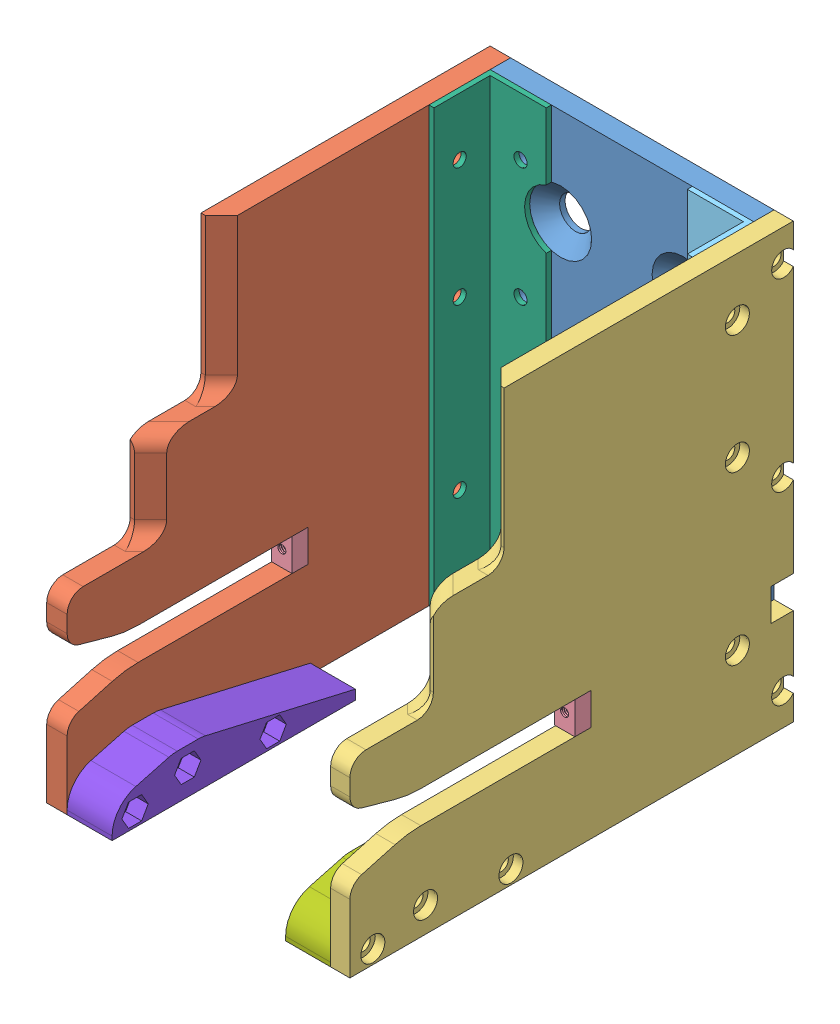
SolidWorks assembly tool housing new - asm.SLDPRT.SLDASM, configuration Default (file format 9000). Lengths in mm.
Overall size (94.35 135 138).
9 component instances, 8 part files, 24 mates.
Components (placement in the parent):
- tool housing new - back-1: tool housing new - back.SLDPRT [Default] at (17.6938 77.2341 112.2696) size (82 135 6.35)
- tool housing new - right-2: tool housing new - right.SLDPRT [Default] at (-29.6562 9.7341 112.2696) x (0 0 -1) z (1 0 0) size (138 135 6.35)
- tool housing new - left-1: tool housing new - left.SLDPRT [Default] at (58.6938 9.7341 112.2696) x (0 0 -1) z (1 0 0) size (138 135 6)
- tool housing new - steel-1: tool housing new - steel.SLDPRT [Default] at (61.5188 44.7341 175.2696) size (6.35 10 5.22)
- tool housing new - steel-2: tool housing new - steel.SLDPRT [Default] at (-26.4812 44.7341 175.2696) size (6.35 10 5.22)
- tool housing new - 90deg - left-1: tool housing new - 90deg - left.SLDPRT [Default] at (58.6938 9.7341 118.6196) x (-1 0 0) z (0 0 -1) size (19.05 135 19.05)
- tool housing new - 90deg - right-2: tool housing new - 90deg - right.SLDPRT [Default] at (-23.3062 9.7341 118.6196) x (0 0 1) z (-1 0 0) size (19.05 135 19.05)
- tool housing new - slide left-1: tool housing new - slide left.SLDPRT [Default] at (44.6938 9.7341 250.2696) x (0 0 -1) z (1 0 0) size (75.71 14 14)
- tool housing new - slide right-1: tool housing new - slide right.SLDPRT [Default] at (-23.3062 9.7341 250.2696) x (0 0 -1) z (1 0 0) size (75.71 14 14)
Mates (geometry in assembly coordinates):
- Coincident5: coincident aligned: plane of tool housing new - back-1 through (58.6938 144.7341 118.6196) normal (0 1 0); plane of tool housing new - right-2 through (-23.3062 144.7341 202.2696) normal (0 1 0)
- Coincident9: coincident aligned: plane of tool housing new - back-1 through (58.6938 144.7341 118.6196) normal (0 1 0); plane of tool housing new - left-1 through (64.6938 144.7341 202.2696) normal (0 1 0)
- Coincident14: coincident anti-aligned: plane of tool housing new - left-1 through (64.6938 39.7341 175.2696) normal (0 0 1); plane of tool housing new - steel-1 through (61.5188 44.7341 175.2696) normal (0 0 -1)
- Coincident15: coincident aligned: plane of tool housing new - left-1 through (64.6938 9.7341 112.2696) normal (1 0 0); plane of tool housing new - steel-1 through (64.6938 39.7341 180.2696) normal (1 0 0)
- Coincident16: coincident anti-aligned: plane of tool housing new - left-1 through (64.6938 49.7341 175.2696) normal (0 -1 0); plane of tool housing new - steel-1 through (64.6938 49.7341 180.2696) normal (0 1 0)
- Coincident17: coincident anti-aligned: plane of tool housing new - right-2 through (-23.3062 39.7341 175.2696) normal (0 0 1); plane of tool housing new - steel-2 through (-26.4812 44.7341 175.2696) normal (0 0 -1)
- Coincident18: coincident aligned: plane of tool housing new - right-2 through (-29.6562 9.7341 112.2696) normal (-1 0 0); plane of tool housing new - steel-2 through (-29.6562 39.7341 180.2696) normal (-1 0 0)
- Coincident19: coincident anti-aligned: plane of tool housing new - right-2 through (-23.3062 49.7341 175.2696) normal (0 -1 0); plane of tool housing new - steel-2 through (-23.3062 49.7341 180.2696) normal (0 1 0)
- Coincident22: coincident aligned: plane of tool housing new - back-1 through (17.6938 77.2341 112.2696) normal (0 0 -1); plane of tool housing new - right-2 through (-23.3062 144.7341 112.2696) normal (0 0 -1)
- Coincident23: coincident aligned: plane of tool housing new - back-1 through (17.6938 77.2341 112.2696) normal (0 0 -1); plane of tool housing new - left-1 through (64.6938 144.7341 112.2696) normal (0 0 -1)
- Coincident24: coincident anti-aligned: plane of tool housing new - back-1 through (58.6938 144.7341 118.6196) normal (1 0 0); plane of tool housing new - left-1 through (58.6938 9.7341 112.2696) normal (-1 0 0)
- Coincident25: coincident anti-aligned: plane of tool housing new - back-1 through (-23.3062 144.7341 118.6196) normal (-1 0 0); plane of tool housing new - right-2 through (-23.3062 9.7341 112.2696) normal (1 0 0)
- Coincident32: coincident anti-aligned: plane of tool housing new - left-1 through (58.6938 9.7341 112.2696) normal (-1 0 0); plane of tool housing new - 90deg - left-1 through (58.6938 144.7341 137.6696) normal (1 0 0)
- Coincident33: coincident anti-aligned: plane of tool housing new - back-1 through (17.6938 77.2341 118.6196) normal (0 0 1); plane of tool housing new - 90deg - left-1 through (58.6938 144.7341 118.6196) normal (0 0 -1)
- Coincident34: coincident aligned: plane of tool housing new - left-1 through (64.6938 144.7341 202.2696) normal (0 1 0); plane of tool housing new - 90deg - left-1 through (58.6938 144.7341 118.6196) normal (0 1 0)
- Coincident36: coincident anti-aligned: plane of tool housing new - right-2 through (-23.3062 9.7341 112.2696) normal (1 0 0); plane of tool housing new - 90deg - right-2 through (-23.3062 144.7341 118.6196) normal (-1 0 0)
- Coincident37: coincident anti-aligned: plane of tool housing new - back-1 through (17.6938 77.2341 118.6196) normal (0 0 1); plane of tool housing new - 90deg - right-2 through (-4.2562 144.7341 118.6196) normal (0 0 -1)
- Coincident38: coincident aligned: plane of tool housing new - back-1 through (58.6938 144.7341 118.6196) normal (0 1 0); plane of tool housing new - 90deg - right-2 through (-23.3062 144.7341 118.6196) normal (0 1 0)
- Coincident43: coincident anti-aligned: plane of tool housing new - right-2 through (-23.3062 9.7341 112.2696) normal (1 0 0); plane of tool housing new - slide right-1 through (-23.3062 9.7341 250.2696) normal (-1 0 0)
- Coincident44: coincident aligned: plane of tool housing new - right-2 through (-23.3062 9.7341 250.2696) normal (0 0 1); plane of tool housing new - slide right-1 through (-9.3062 9.7341 250.2696) normal (0 0 1)
- Coincident45: coincident aligned: plane of tool housing new - right-2 through (-23.3062 9.7341 112.2696) normal (0 -1 0); plane of tool housing new - slide right-1 through (-9.3062 9.7341 174.5615) normal (0 -1 0)
- Coincident47: coincident aligned: plane of tool housing new - left-1 through (64.6938 9.7341 250.2696) normal (0 0 1); plane of tool housing new - slide left-1 through (58.6938 9.7341 250.2696) normal (0 0 1)
- Coincident48: coincident aligned: plane of tool housing new - left-1 through (64.6938 9.7341 112.2696) normal (0 -1 0); plane of tool housing new - slide left-1 through (58.6938 9.7341 174.5615) normal (0 -1 0)
- Coincident49: coincident anti-aligned: plane of tool housing new - left-1 through (58.6938 9.7341 112.2696) normal (-1 0 0); plane of tool housing new - slide left-1 through (58.6938 9.7341 250.2696) normal (1 0 0)
